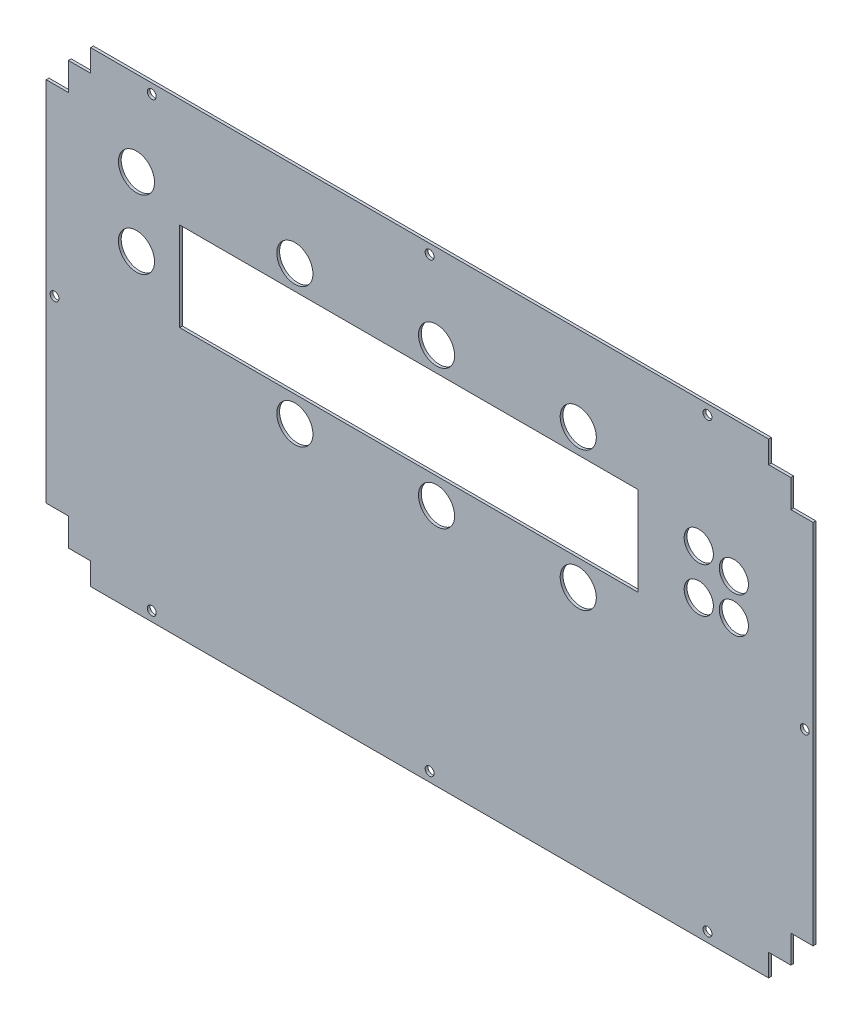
from build123d import *

# Parameters (mm, degrees)
EXTRUDE1_DEPTH        = 1
SKETCH2_W             = 165
SKETCH2_H             = 32
CUT_EXTRUDE1_DEPTH    = 1
SKETCH3_R             = 6.5
SKETCH3_R_2           = 5.25
CUT_EXTRUDE2_DEPTH    = 1
ESBO_O1_R             = 1.6
CORTE_EXTRUS_O1_DEPTH = 162.558039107


with BuildPart() as part:
    # Sketch1 → Extrude1 (new body)
    with BuildSketch(Plane.XY):
        Polygon((-122, 84), (122, 84), (122, 76), (130, 76), (130, 66), (138, 66), (138, -66), (130, -66), (130, -76), (122, -76), (122, -84), (-122, -84), (-122, -76), (-130, -76), (-130, -66), (-138, -66), (-138, 66), (-130, 66), (-130, 76), (-122, 76), align=None)
    extrude(amount=EXTRUDE1_DEPTH)

    # Sketch2 → Cut-Extrude1 (cut)
    with BuildSketch(Plane.XY.offset(1)):
        with Locations((-7.5, 28.75)):
            Rectangle(SKETCH2_W, SKETCH2_H)
    extrude(amount=-CUT_EXTRUDE1_DEPTH, mode=Mode.SUBTRACT)

    # Sketch3 → Cut-Extrude2 (cut)
    with BuildSketch(Plane.XY.offset(1)):
        with Locations((-105.5, 53.5)):
            Circle(SKETCH3_R)
        with Locations((-105.5, 28.75)):
            Circle(SKETCH3_R)
        with Locations((-48.5, 3.5)):
            Circle(SKETCH3_R)
        with Locations((2.5, 3.5)):
            Circle(SKETCH3_R)
        with Locations((53.5, 3.5)):
            Circle(SKETCH3_R)
        with Locations((53.5, 53.5)):
            Circle(SKETCH3_R)
        with Locations((2.5, 53.5)):
            Circle(SKETCH3_R)
        with Locations((-48.5, 53.5)):
            Circle(SKETCH3_R)
        with Locations((96.873262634, 38.092814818)):
            Circle(SKETCH3_R_2)
        with Locations((109.5, 35)):
            Circle(SKETCH3_R_2)
        with Locations((109.5, 22)):
            Circle(SKETCH3_R_2)
        with Locations((96.873262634, 22)):
            Circle(SKETCH3_R_2)
    extrude(amount=-CUT_EXTRUDE2_DEPTH, mode=Mode.SUBTRACT)

    # Esbo_o1 → Corte-extrus_o1 (cut, through all)
    with BuildSketch(Plane.XY.offset(1)):
        with Locations((0, -80.5)):
            Circle(ESBO_O1_R)
        with Locations((-100, -80.5)):
            Circle(ESBO_O1_R)
        with Locations((100, -80.5)):
            Circle(ESBO_O1_R)
        with Locations((-135, 0)):
            Circle(ESBO_O1_R)
        with Locations((135, 0)):
            Circle(ESBO_O1_R)
        with Locations(Location((100, 80.5, 0), (0, 0, 180))):
            Circle(ESBO_O1_R)
        with Locations(Location((-100, 80.5, 0), (0, 0, 180))):
            Circle(ESBO_O1_R)
        with Locations(Location((0, 80.5, 0), (0, 0, 180))):
            Circle(ESBO_O1_R)
    extrude(amount=-CORTE_EXTRUS_O1_DEPTH, mode=Mode.SUBTRACT)


solid = part.part
